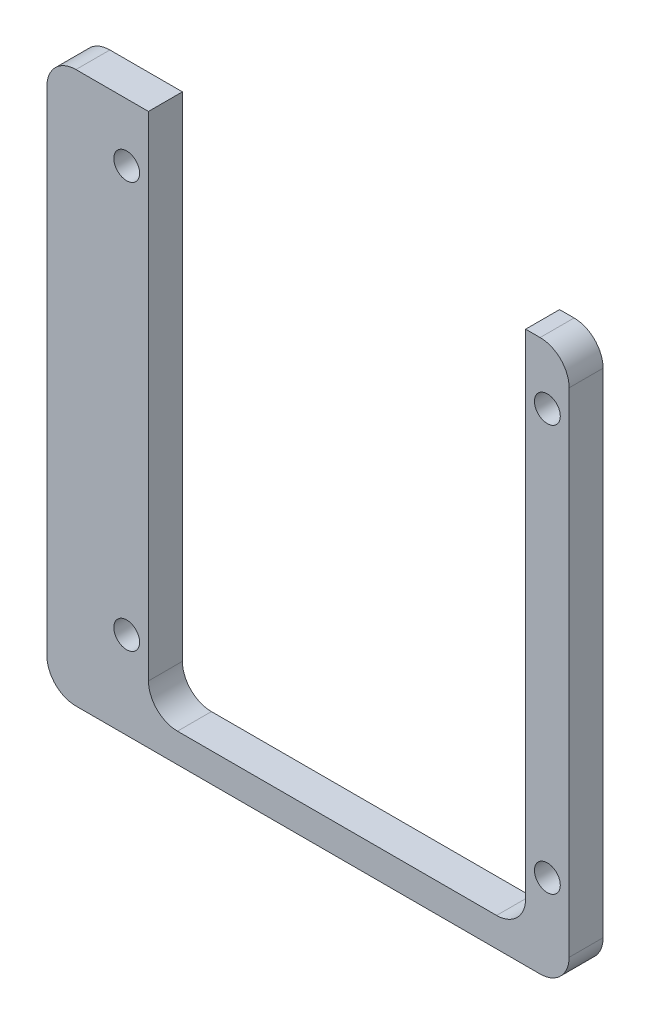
ISO-10303-21;
HEADER;
FILE_DESCRIPTION(('STEP AP214'),'2;1');
FILE_NAME('part.step','',(''),(''),'','','');
FILE_SCHEMA(('AUTOMOTIVE_DESIGN { 1 0 10303 214 1 1 1 1 }'));
ENDSEC;
DATA;
#1=APPLICATION_CONTEXT('core data for automotive mechanical design processes');
#2=APPLICATION_PROTOCOL_DEFINITION('international standard','automotive_design',2000,#1);
#3=PRODUCT_CONTEXT('',#1,'mechanical');
#4=PRODUCT('Part','Part','',(#3));
#5=PRODUCT_RELATED_PRODUCT_CATEGORY('part','',(#4));
#6=PRODUCT_DEFINITION_FORMATION('','',#4);
#7=PRODUCT_DEFINITION_CONTEXT('part definition',#1,'design');
#8=PRODUCT_DEFINITION('design','',#6,#7);
#9=PRODUCT_DEFINITION_SHAPE('','',#8);
#10=(LENGTH_UNIT() NAMED_UNIT(*) SI_UNIT(.MILLI.,.METRE.));
#11=(NAMED_UNIT(*) PLANE_ANGLE_UNIT() SI_UNIT($,.RADIAN.));
#12=(NAMED_UNIT(*) SI_UNIT($,.STERADIAN.) SOLID_ANGLE_UNIT());
#13=UNCERTAINTY_MEASURE_WITH_UNIT(LENGTH_MEASURE(1.E-05),#10,'distance_accuracy_value','');
#14=(GEOMETRIC_REPRESENTATION_CONTEXT(3) GLOBAL_UNCERTAINTY_ASSIGNED_CONTEXT((#13)) GLOBAL_UNIT_ASSIGNED_CONTEXT((#10,
#11,#12)) REPRESENTATION_CONTEXT('',''));
#15=CARTESIAN_POINT('',(0.,0.,0.));
#16=DIRECTION('',(0.,0.,1.));
#17=DIRECTION('',(1.,0.,0.));
#18=AXIS2_PLACEMENT_3D('',#15,#16,#17);
#19=CARTESIAN_POINT('',(-22.86,24.13,2.9718));
#20=DIRECTION('',(0.,-1.,0.));
#21=DIRECTION('',(0.,0.,-1.));
#22=AXIS2_PLACEMENT_3D('',#19,#20,#21);
#23=PLANE('',#22);
#24=DIRECTION('',(-1.,0.,0.));
#25=VECTOR('',#24,1.);
#26=CARTESIAN_POINT('',(-22.86,24.13,2.9718));
#27=LINE('',#26,#25);
#28=CARTESIAN_POINT('',(20.32,24.13,2.9718));
#29=VERTEX_POINT('',#28);
#30=CARTESIAN_POINT('',(19.05,24.13,2.9718));
#31=VERTEX_POINT('',#30);
#32=EDGE_CURVE('E182',#29,#31,#27,.T.);
#33=ORIENTED_EDGE('',*,*,#32,.F.);
#34=DIRECTION('',(0.,0.,-1.));
#35=VECTOR('',#34,1.);
#36=CARTESIAN_POINT('',(20.32,24.13,2.9718));
#37=LINE('',#36,#35);
#38=CARTESIAN_POINT('',(20.32,24.13,0.));
#39=VERTEX_POINT('',#38);
#40=EDGE_CURVE('E148',#29,#39,#37,.T.);
#41=ORIENTED_EDGE('',*,*,#40,.T.);
#42=DIRECTION('',(-1.,0.,0.));
#43=VECTOR('',#42,1.);
#44=CARTESIAN_POINT('',(-22.86,24.13,0.));
#45=LINE('',#44,#43);
#46=CARTESIAN_POINT('',(19.05,24.13,0.));
#47=VERTEX_POINT('',#46);
#48=EDGE_CURVE('E143',#39,#47,#45,.T.);
#49=ORIENTED_EDGE('',*,*,#48,.T.);
#50=DIRECTION('',(0.,0.,1.));
#51=VECTOR('',#50,1.);
#52=CARTESIAN_POINT('',(19.05,24.13,0.));
#53=LINE('',#52,#51);
#54=EDGE_CURVE('E146',#47,#31,#53,.T.);
#55=ORIENTED_EDGE('',*,*,#54,.T.);
#56=EDGE_LOOP('',(#33,#41,#49,#55));
#57=FACE_BOUND('',#56,.T.);
#58=ADVANCED_FACE('F39',(#57),#23,.F.);
#59=CARTESIAN_POINT('',(22.86,24.13,2.9718));
#60=DIRECTION('',(-1.,0.,0.));
#61=DIRECTION('',(0.,-1.,0.));
#62=AXIS2_PLACEMENT_3D('',#59,#60,#61);
#63=PLANE('',#62);
#64=DIRECTION('',(0.,1.,0.));
#65=VECTOR('',#64,1.);
#66=CARTESIAN_POINT('',(22.86,24.13,2.9718));
#67=LINE('',#66,#65);
#68=CARTESIAN_POINT('',(22.86,-21.59,2.9718));
#69=VERTEX_POINT('',#68);
#70=CARTESIAN_POINT('',(22.86,21.59,2.9718));
#71=VERTEX_POINT('',#70);
#72=EDGE_CURVE('E178',#69,#71,#67,.T.);
#73=ORIENTED_EDGE('',*,*,#72,.F.);
#74=DIRECTION('',(0.,0.,-1.));
#75=VECTOR('',#74,1.);
#76=CARTESIAN_POINT('',(22.86,-21.59,2.9718));
#77=LINE('',#76,#75);
#78=CARTESIAN_POINT('',(22.86,-21.59,0.));
#79=VERTEX_POINT('',#78);
#80=EDGE_CURVE('E196',#69,#79,#77,.T.);
#81=ORIENTED_EDGE('',*,*,#80,.T.);
#82=DIRECTION('',(0.,1.,0.));
#83=VECTOR('',#82,1.);
#84=CARTESIAN_POINT('',(22.86,24.13,0.));
#85=LINE('',#84,#83);
#86=CARTESIAN_POINT('',(22.86,21.59,0.));
#87=VERTEX_POINT('',#86);
#88=EDGE_CURVE('E173',#79,#87,#85,.T.);
#89=ORIENTED_EDGE('',*,*,#88,.T.);
#90=DIRECTION('',(0.,0.,-1.));
#91=VECTOR('',#90,1.);
#92=CARTESIAN_POINT('',(22.86,21.59,2.9718));
#93=LINE('',#92,#91);
#94=EDGE_CURVE('E189',#87,#71,#93,.F.);
#95=ORIENTED_EDGE('',*,*,#94,.T.);
#96=EDGE_LOOP('',(#73,#81,#89,#95));
#97=FACE_BOUND('',#96,.T.);
#98=ADVANCED_FACE('F317',(#97),#63,.F.);
#99=CARTESIAN_POINT('',(-13.97,24.13,0.));
#100=VERTEX_POINT('',#99);
#101=CARTESIAN_POINT('',(-20.32,24.13,0.));
#102=VERTEX_POINT('',#101);
#103=EDGE_CURVE('E151',#100,#102,#45,.T.);
#104=ORIENTED_EDGE('',*,*,#103,.T.);
#105=DIRECTION('',(0.,0.,-1.));
#106=VECTOR('',#105,1.);
#107=CARTESIAN_POINT('',(-20.32,24.13,2.9718));
#108=LINE('',#107,#106);
#109=CARTESIAN_POINT('',(-20.32,24.13,2.9718));
#110=VERTEX_POINT('',#109);
#111=EDGE_CURVE('E223',#102,#110,#108,.F.);
#112=ORIENTED_EDGE('',*,*,#111,.T.);
#113=CARTESIAN_POINT('',(-13.97,24.13,2.9718));
#114=VERTEX_POINT('',#113);
#115=EDGE_CURVE('E180',#114,#110,#27,.T.);
#116=ORIENTED_EDGE('',*,*,#115,.F.);
#117=DIRECTION('',(0.,0.,1.));
#118=VECTOR('',#117,1.);
#119=CARTESIAN_POINT('',(-13.97,24.13,0.));
#120=LINE('',#119,#118);
#121=EDGE_CURVE('E170',#100,#114,#120,.T.);
#122=ORIENTED_EDGE('',*,*,#121,.F.);
#123=EDGE_LOOP('',(#104,#112,#116,#122));
#124=FACE_BOUND('',#123,.T.);
#125=ADVANCED_FACE('F319',(#124),#23,.F.);
#126=CARTESIAN_POINT('',(-22.86,24.13,2.9718));
#127=DIRECTION('',(1.,0.,0.));
#128=DIRECTION('',(0.,1.,0.));
#129=AXIS2_PLACEMENT_3D('',#126,#127,#128);
#130=PLANE('',#129);
#131=DIRECTION('',(0.,-1.,0.));
#132=VECTOR('',#131,1.);
#133=CARTESIAN_POINT('',(-22.86,24.13,0.));
#134=LINE('',#133,#132);
#135=CARTESIAN_POINT('',(-22.86,21.59,0.));
#136=VERTEX_POINT('',#135);
#137=CARTESIAN_POINT('',(-22.86,-21.59,0.));
#138=VERTEX_POINT('',#137);
#139=EDGE_CURVE('E150',#136,#138,#134,.T.);
#140=ORIENTED_EDGE('',*,*,#139,.T.);
#141=DIRECTION('',(0.,0.,-1.));
#142=VECTOR('',#141,1.);
#143=CARTESIAN_POINT('',(-22.86,-21.59,2.9718));
#144=LINE('',#143,#142);
#145=CARTESIAN_POINT('',(-22.86,-21.59,2.9718));
#146=VERTEX_POINT('',#145);
#147=EDGE_CURVE('E62',#138,#146,#144,.F.);
#148=ORIENTED_EDGE('',*,*,#147,.T.);
#149=DIRECTION('',(0.,-1.,0.));
#150=VECTOR('',#149,1.);
#151=CARTESIAN_POINT('',(-22.86,24.13,2.9718));
#152=LINE('',#151,#150);
#153=CARTESIAN_POINT('',(-22.86,21.59,2.9718));
#154=VERTEX_POINT('',#153);
#155=EDGE_CURVE('E184',#154,#146,#152,.T.);
#156=ORIENTED_EDGE('',*,*,#155,.F.);
#157=DIRECTION('',(0.,0.,-1.));
#158=VECTOR('',#157,1.);
#159=CARTESIAN_POINT('',(-22.86,21.59,2.9718));
#160=LINE('',#159,#158);
#161=EDGE_CURVE('E219',#154,#136,#160,.T.);
#162=ORIENTED_EDGE('',*,*,#161,.T.);
#163=EDGE_LOOP('',(#140,#148,#156,#162));
#164=FACE_BOUND('',#163,.T.);
#165=ADVANCED_FACE('F327',(#164),#130,.F.);
#166=CARTESIAN_POINT('',(-22.86,-24.13,2.9718));
#167=DIRECTION('',(0.,1.,0.));
#168=DIRECTION('',(0.,0.,1.));
#169=AXIS2_PLACEMENT_3D('',#166,#167,#168);
#170=PLANE('',#169);
#171=DIRECTION('',(1.,0.,0.));
#172=VECTOR('',#171,1.);
#173=CARTESIAN_POINT('',(-22.86,-24.13,0.));
#174=LINE('',#173,#172);
#175=CARTESIAN_POINT('',(-20.32,-24.13,0.));
#176=VERTEX_POINT('',#175);
#177=CARTESIAN_POINT('',(20.32,-24.13,0.));
#178=VERTEX_POINT('',#177);
#179=EDGE_CURVE('E181',#176,#178,#174,.T.);
#180=ORIENTED_EDGE('',*,*,#179,.T.);
#181=DIRECTION('',(0.,0.,-1.));
#182=VECTOR('',#181,1.);
#183=CARTESIAN_POINT('',(20.32,-24.13,2.9718));
#184=LINE('',#183,#182);
#185=CARTESIAN_POINT('',(20.32,-24.13,2.9718));
#186=VERTEX_POINT('',#185);
#187=EDGE_CURVE('E210',#178,#186,#184,.F.);
#188=ORIENTED_EDGE('',*,*,#187,.T.);
#189=DIRECTION('',(1.,0.,0.));
#190=VECTOR('',#189,1.);
#191=CARTESIAN_POINT('',(-22.86,-24.13,2.9718));
#192=LINE('',#191,#190);
#193=CARTESIAN_POINT('',(-20.32,-24.13,2.9718));
#194=VERTEX_POINT('',#193);
#195=EDGE_CURVE('E186',#194,#186,#192,.T.);
#196=ORIENTED_EDGE('',*,*,#195,.F.);
#197=DIRECTION('',(0.,0.,-1.));
#198=VECTOR('',#197,1.);
#199=CARTESIAN_POINT('',(-20.32,-24.13,2.9718));
#200=LINE('',#199,#198);
#201=EDGE_CURVE('E207',#194,#176,#200,.T.);
#202=ORIENTED_EDGE('',*,*,#201,.T.);
#203=EDGE_LOOP('',(#180,#188,#196,#202));
#204=FACE_BOUND('',#203,.T.);
#205=ADVANCED_FACE('F293',(#204),#170,.F.);
#206=CARTESIAN_POINT('',(0.,0.,2.9718));
#207=DIRECTION('',(0.,0.,1.));
#208=DIRECTION('',(1.,0.,0.));
#209=AXIS2_PLACEMENT_3D('',#206,#207,#208);
#210=PLANE('',#209);
#211=CARTESIAN_POINT('',(-15.875,19.05,2.9718));
#212=DIRECTION('',(0.,0.,1.));
#213=DIRECTION('',(1.,0.,0.));
#214=AXIS2_PLACEMENT_3D('',#211,#212,#213);
#215=CIRCLE('',#214,1.1303);
#216=CARTESIAN_POINT('',(-14.7447,19.05,2.9718));
#217=VERTEX_POINT('',#216);
#218=EDGE_CURVE('E285',#217,#217,#215,.T.);
#219=ORIENTED_EDGE('',*,*,#218,.F.);
#220=EDGE_LOOP('',(#219));
#221=FACE_BOUND('',#220,.T.);
#222=CARTESIAN_POINT('',(-15.875,-16.51,2.9718));
#223=DIRECTION('',(0.,0.,1.));
#224=DIRECTION('',(1.,0.,0.));
#225=AXIS2_PLACEMENT_3D('',#222,#223,#224);
#226=CIRCLE('',#225,1.1303);
#227=CARTESIAN_POINT('',(-14.7447,-16.51,2.9718));
#228=VERTEX_POINT('',#227);
#229=EDGE_CURVE('E279',#228,#228,#226,.T.);
#230=ORIENTED_EDGE('',*,*,#229,.F.);
#231=EDGE_LOOP('',(#230));
#232=FACE_BOUND('',#231,.T.);
#233=CARTESIAN_POINT('',(20.955,19.05,2.9718));
#234=DIRECTION('',(0.,0.,1.));
#235=DIRECTION('',(1.,0.,0.));
#236=AXIS2_PLACEMENT_3D('',#233,#234,#235);
#237=CIRCLE('',#236,1.1303);
#238=CARTESIAN_POINT('',(22.0853,19.05,2.9718));
#239=VERTEX_POINT('',#238);
#240=EDGE_CURVE('E273',#239,#239,#237,.T.);
#241=ORIENTED_EDGE('',*,*,#240,.F.);
#242=EDGE_LOOP('',(#241));
#243=FACE_BOUND('',#242,.T.);
#244=CARTESIAN_POINT('',(20.955,-16.51,2.9718));
#245=DIRECTION('',(0.,0.,1.));
#246=DIRECTION('',(1.,0.,0.));
#247=AXIS2_PLACEMENT_3D('',#244,#245,#246);
#248=CIRCLE('',#247,1.1303);
#249=CARTESIAN_POINT('',(22.0853,-16.51,2.9718));
#250=VERTEX_POINT('',#249);
#251=EDGE_CURVE('E264',#250,#250,#248,.T.);
#252=ORIENTED_EDGE('',*,*,#251,.F.);
#253=EDGE_LOOP('',(#252));
#254=FACE_BOUND('',#253,.T.);
#255=ORIENTED_EDGE('',*,*,#195,.T.);
#256=CARTESIAN_POINT('',(20.32,-21.59,2.9718));
#257=DIRECTION('',(0.,0.,1.));
#258=DIRECTION('',(1.,0.,0.));
#259=AXIS2_PLACEMENT_3D('',#256,#257,#258);
#260=CIRCLE('',#259,2.54);
#261=EDGE_CURVE('E217',#186,#69,#260,.T.);
#262=ORIENTED_EDGE('',*,*,#261,.T.);
#263=ORIENTED_EDGE('',*,*,#72,.T.);
#264=CARTESIAN_POINT('',(20.32,21.59,2.9718));
#265=DIRECTION('',(0.,0.,1.));
#266=DIRECTION('',(1.,0.,0.));
#267=AXIS2_PLACEMENT_3D('',#264,#265,#266);
#268=CIRCLE('',#267,2.54);
#269=EDGE_CURVE('E54',#71,#29,#268,.T.);
#270=ORIENTED_EDGE('',*,*,#269,.T.);
#271=ORIENTED_EDGE('',*,*,#32,.T.);
#272=DIRECTION('',(0.,1.,0.));
#273=VECTOR('',#272,1.);
#274=CARTESIAN_POINT('',(19.05,24.13,2.9718));
#275=LINE('',#274,#273);
#276=CARTESIAN_POINT('',(19.05,-19.05,2.9718));
#277=VERTEX_POINT('',#276);
#278=EDGE_CURVE('E169',#277,#31,#275,.T.);
#279=ORIENTED_EDGE('',*,*,#278,.F.);
#280=CARTESIAN_POINT('',(16.51,-19.05,2.9718));
#281=DIRECTION('',(0.,0.,1.));
#282=DIRECTION('',(1.,0.,0.));
#283=AXIS2_PLACEMENT_3D('',#280,#281,#282);
#284=CIRCLE('',#283,2.54);
#285=CARTESIAN_POINT('',(16.51,-21.59,2.9718));
#286=VERTEX_POINT('',#285);
#287=EDGE_CURVE('E235',#277,#286,#284,.F.);
#288=ORIENTED_EDGE('',*,*,#287,.T.);
#289=DIRECTION('',(1.,0.,0.));
#290=VECTOR('',#289,1.);
#291=CARTESIAN_POINT('',(-13.97,-21.59,2.9718));
#292=LINE('',#291,#290);
#293=CARTESIAN_POINT('',(-11.43,-21.59,2.9718));
#294=VERTEX_POINT('',#293);
#295=EDGE_CURVE('E164',#294,#286,#292,.T.);
#296=ORIENTED_EDGE('',*,*,#295,.F.);
#297=CARTESIAN_POINT('',(-11.43,-19.05,2.9718));
#298=DIRECTION('',(0.,0.,1.));
#299=DIRECTION('',(1.,0.,0.));
#300=AXIS2_PLACEMENT_3D('',#297,#298,#299);
#301=CIRCLE('',#300,2.54);
#302=CARTESIAN_POINT('',(-13.97,-19.05,2.9718));
#303=VERTEX_POINT('',#302);
#304=EDGE_CURVE('E47',#294,#303,#301,.F.);
#305=ORIENTED_EDGE('',*,*,#304,.T.);
#306=DIRECTION('',(0.,-1.,0.));
#307=VECTOR('',#306,1.);
#308=CARTESIAN_POINT('',(-13.97,24.13,2.9718));
#309=LINE('',#308,#307);
#310=EDGE_CURVE('E242',#114,#303,#309,.T.);
#311=ORIENTED_EDGE('',*,*,#310,.F.);
#312=ORIENTED_EDGE('',*,*,#115,.T.);
#313=CARTESIAN_POINT('',(-20.32,21.59,2.9718));
#314=DIRECTION('',(0.,0.,1.));
#315=DIRECTION('',(1.,0.,0.));
#316=AXIS2_PLACEMENT_3D('',#313,#314,#315);
#317=CIRCLE('',#316,2.54);
#318=EDGE_CURVE('E213',#110,#154,#317,.T.);
#319=ORIENTED_EDGE('',*,*,#318,.T.);
#320=ORIENTED_EDGE('',*,*,#155,.T.);
#321=CARTESIAN_POINT('',(-20.32,-21.59,2.9718));
#322=DIRECTION('',(0.,0.,1.));
#323=DIRECTION('',(1.,0.,0.));
#324=AXIS2_PLACEMENT_3D('',#321,#322,#323);
#325=CIRCLE('',#324,2.54);
#326=EDGE_CURVE('E215',#146,#194,#325,.T.);
#327=ORIENTED_EDGE('',*,*,#326,.T.);
#328=EDGE_LOOP('',(#255,#262,#263,#270,#271,#279,#288,#296,#305,#311,#312,#319,#320,#327));
#329=FACE_BOUND('',#328,.T.);
#330=ADVANCED_FACE('F240',(#221,#232,#243,#254,#329),#210,.T.);
#331=CARTESIAN_POINT('',(0.,0.,0.));
#332=DIRECTION('',(0.,0.,1.));
#333=DIRECTION('',(1.,0.,0.));
#334=AXIS2_PLACEMENT_3D('',#331,#332,#333);
#335=PLANE('',#334);
#336=CARTESIAN_POINT('',(-15.875,19.05,0.));
#337=DIRECTION('',(0.,0.,1.));
#338=DIRECTION('',(1.,0.,0.));
#339=AXIS2_PLACEMENT_3D('',#336,#337,#338);
#340=CIRCLE('',#339,1.1303);
#341=CARTESIAN_POINT('',(-14.7447,19.05,0.));
#342=VERTEX_POINT('',#341);
#343=EDGE_CURVE('E282',#342,#342,#340,.T.);
#344=ORIENTED_EDGE('',*,*,#343,.T.);
#345=EDGE_LOOP('',(#344));
#346=FACE_BOUND('',#345,.T.);
#347=CARTESIAN_POINT('',(-15.875,-16.51,0.));
#348=DIRECTION('',(0.,0.,1.));
#349=DIRECTION('',(1.,0.,0.));
#350=AXIS2_PLACEMENT_3D('',#347,#348,#349);
#351=CIRCLE('',#350,1.1303);
#352=CARTESIAN_POINT('',(-14.7447,-16.51,0.));
#353=VERTEX_POINT('',#352);
#354=EDGE_CURVE('E276',#353,#353,#351,.T.);
#355=ORIENTED_EDGE('',*,*,#354,.T.);
#356=EDGE_LOOP('',(#355));
#357=FACE_BOUND('',#356,.T.);
#358=CARTESIAN_POINT('',(20.955,19.05,0.));
#359=DIRECTION('',(0.,0.,1.));
#360=DIRECTION('',(1.,0.,0.));
#361=AXIS2_PLACEMENT_3D('',#358,#359,#360);
#362=CIRCLE('',#361,1.1303);
#363=CARTESIAN_POINT('',(22.0853,19.05,0.));
#364=VERTEX_POINT('',#363);
#365=EDGE_CURVE('E270',#364,#364,#362,.T.);
#366=ORIENTED_EDGE('',*,*,#365,.T.);
#367=EDGE_LOOP('',(#366));
#368=FACE_BOUND('',#367,.T.);
#369=CARTESIAN_POINT('',(20.955,-16.51,0.));
#370=DIRECTION('',(0.,0.,1.));
#371=DIRECTION('',(1.,0.,0.));
#372=AXIS2_PLACEMENT_3D('',#369,#370,#371);
#373=CIRCLE('',#372,1.1303);
#374=CARTESIAN_POINT('',(22.0853,-16.51,0.));
#375=VERTEX_POINT('',#374);
#376=EDGE_CURVE('E261',#375,#375,#373,.T.);
#377=ORIENTED_EDGE('',*,*,#376,.T.);
#378=EDGE_LOOP('',(#377));
#379=FACE_BOUND('',#378,.T.);
#380=ORIENTED_EDGE('',*,*,#88,.F.);
#381=CARTESIAN_POINT('',(20.32,-21.59,0.));
#382=DIRECTION('',(0.,0.,1.));
#383=DIRECTION('',(1.,0.,0.));
#384=AXIS2_PLACEMENT_3D('',#381,#382,#383);
#385=CIRCLE('',#384,2.54);
#386=EDGE_CURVE('E205',#79,#178,#385,.F.);
#387=ORIENTED_EDGE('',*,*,#386,.T.);
#388=ORIENTED_EDGE('',*,*,#179,.F.);
#389=CARTESIAN_POINT('',(-20.32,-21.59,0.));
#390=DIRECTION('',(0.,0.,1.));
#391=DIRECTION('',(1.,0.,0.));
#392=AXIS2_PLACEMENT_3D('',#389,#390,#391);
#393=CIRCLE('',#392,2.54);
#394=EDGE_CURVE('E203',#176,#138,#393,.F.);
#395=ORIENTED_EDGE('',*,*,#394,.T.);
#396=ORIENTED_EDGE('',*,*,#139,.F.);
#397=CARTESIAN_POINT('',(-20.32,21.59,0.));
#398=DIRECTION('',(0.,0.,1.));
#399=DIRECTION('',(1.,0.,0.));
#400=AXIS2_PLACEMENT_3D('',#397,#398,#399);
#401=CIRCLE('',#400,2.54);
#402=EDGE_CURVE('E201',#136,#102,#401,.F.);
#403=ORIENTED_EDGE('',*,*,#402,.T.);
#404=ORIENTED_EDGE('',*,*,#103,.F.);
#405=DIRECTION('',(0.,-1.,0.));
#406=VECTOR('',#405,1.);
#407=CARTESIAN_POINT('',(-13.97,24.13,0.));
#408=LINE('',#407,#406);
#409=CARTESIAN_POINT('',(-13.97,-19.05,0.));
#410=VERTEX_POINT('',#409);
#411=EDGE_CURVE('E163',#100,#410,#408,.T.);
#412=ORIENTED_EDGE('',*,*,#411,.T.);
#413=CARTESIAN_POINT('',(-11.43,-19.05,0.));
#414=DIRECTION('',(0.,0.,1.));
#415=DIRECTION('',(1.,0.,0.));
#416=AXIS2_PLACEMENT_3D('',#413,#414,#415);
#417=CIRCLE('',#416,2.54);
#418=CARTESIAN_POINT('',(-11.43,-21.59,0.));
#419=VERTEX_POINT('',#418);
#420=EDGE_CURVE('E11',#410,#419,#417,.T.);
#421=ORIENTED_EDGE('',*,*,#420,.T.);
#422=DIRECTION('',(1.,0.,0.));
#423=VECTOR('',#422,1.);
#424=CARTESIAN_POINT('',(-13.97,-21.59,0.));
#425=LINE('',#424,#423);
#426=CARTESIAN_POINT('',(16.51,-21.59,0.));
#427=VERTEX_POINT('',#426);
#428=EDGE_CURVE('E171',#419,#427,#425,.T.);
#429=ORIENTED_EDGE('',*,*,#428,.T.);
#430=CARTESIAN_POINT('',(16.51,-19.05,0.));
#431=DIRECTION('',(0.,0.,1.));
#432=DIRECTION('',(1.,0.,0.));
#433=AXIS2_PLACEMENT_3D('',#430,#431,#432);
#434=CIRCLE('',#433,2.54);
#435=CARTESIAN_POINT('',(19.05,-19.05,0.));
#436=VERTEX_POINT('',#435);
#437=EDGE_CURVE('E159',#427,#436,#434,.T.);
#438=ORIENTED_EDGE('',*,*,#437,.T.);
#439=DIRECTION('',(0.,1.,0.));
#440=VECTOR('',#439,1.);
#441=CARTESIAN_POINT('',(19.05,24.13,0.));
#442=LINE('',#441,#440);
#443=EDGE_CURVE('E154',#436,#47,#442,.T.);
#444=ORIENTED_EDGE('',*,*,#443,.T.);
#445=ORIENTED_EDGE('',*,*,#48,.F.);
#446=CARTESIAN_POINT('',(20.32,21.59,0.));
#447=DIRECTION('',(0.,0.,1.));
#448=DIRECTION('',(1.,0.,0.));
#449=AXIS2_PLACEMENT_3D('',#446,#447,#448);
#450=CIRCLE('',#449,2.54);
#451=EDGE_CURVE('E199',#39,#87,#450,.F.);
#452=ORIENTED_EDGE('',*,*,#451,.T.);
#453=EDGE_LOOP('',(#380,#387,#388,#395,#396,#403,#404,#412,#421,#429,#438,#444,#445,#452));
#454=FACE_BOUND('',#453,.T.);
#455=ADVANCED_FACE('F156',(#346,#357,#368,#379,#454),#335,.F.);
#456=CARTESIAN_POINT('',(19.05,24.13,0.));
#457=DIRECTION('',(1.,0.,0.));
#458=DIRECTION('',(0.,1.,0.));
#459=AXIS2_PLACEMENT_3D('',#456,#457,#458);
#460=PLANE('',#459);
#461=ORIENTED_EDGE('',*,*,#443,.F.);
#462=DIRECTION('',(0.,0.,1.));
#463=VECTOR('',#462,1.);
#464=CARTESIAN_POINT('',(19.05,-19.05,2.9718));
#465=LINE('',#464,#463);
#466=EDGE_CURVE('E226',#436,#277,#465,.T.);
#467=ORIENTED_EDGE('',*,*,#466,.T.);
#468=ORIENTED_EDGE('',*,*,#278,.T.);
#469=ORIENTED_EDGE('',*,*,#54,.F.);
#470=EDGE_LOOP('',(#461,#467,#468,#469));
#471=FACE_BOUND('',#470,.T.);
#472=ADVANCED_FACE('F167',(#471),#460,.F.);
#473=CARTESIAN_POINT('',(-13.97,-21.59,0.));
#474=DIRECTION('',(0.,-1.,0.));
#475=DIRECTION('',(0.,0.,-1.));
#476=AXIS2_PLACEMENT_3D('',#473,#474,#475);
#477=PLANE('',#476);
#478=ORIENTED_EDGE('',*,*,#295,.T.);
#479=DIRECTION('',(0.,0.,1.));
#480=VECTOR('',#479,1.);
#481=CARTESIAN_POINT('',(16.51,-21.59,0.));
#482=LINE('',#481,#480);
#483=EDGE_CURVE('E231',#286,#427,#482,.F.);
#484=ORIENTED_EDGE('',*,*,#483,.T.);
#485=ORIENTED_EDGE('',*,*,#428,.F.);
#486=DIRECTION('',(0.,0.,1.));
#487=VECTOR('',#486,1.);
#488=CARTESIAN_POINT('',(-11.43,-21.59,2.9718));
#489=LINE('',#488,#487);
#490=EDGE_CURVE('E228',#419,#294,#489,.T.);
#491=ORIENTED_EDGE('',*,*,#490,.T.);
#492=EDGE_LOOP('',(#478,#484,#485,#491));
#493=FACE_BOUND('',#492,.T.);
#494=ADVANCED_FACE('F257',(#493),#477,.F.);
#495=CARTESIAN_POINT('',(-13.97,24.13,0.));
#496=DIRECTION('',(-1.,0.,0.));
#497=DIRECTION('',(0.,-1.,0.));
#498=AXIS2_PLACEMENT_3D('',#495,#496,#497);
#499=PLANE('',#498);
#500=ORIENTED_EDGE('',*,*,#310,.T.);
#501=DIRECTION('',(0.,0.,1.));
#502=VECTOR('',#501,1.);
#503=CARTESIAN_POINT('',(-13.97,-19.05,0.));
#504=LINE('',#503,#502);
#505=EDGE_CURVE('E233',#303,#410,#504,.F.);
#506=ORIENTED_EDGE('',*,*,#505,.T.);
#507=ORIENTED_EDGE('',*,*,#411,.F.);
#508=ORIENTED_EDGE('',*,*,#121,.T.);
#509=EDGE_LOOP('',(#500,#506,#507,#508));
#510=FACE_BOUND('',#509,.T.);
#511=ADVANCED_FACE('F249',(#510),#499,.F.);
#512=CARTESIAN_POINT('',(20.955,-16.51,2.9718));
#513=DIRECTION('',(0.,0.,1.));
#514=DIRECTION('',(1.,0.,0.));
#515=AXIS2_PLACEMENT_3D('',#512,#513,#514);
#516=CYLINDRICAL_SURFACE('',#515,1.1303);
#517=ORIENTED_EDGE('',*,*,#376,.F.);
#518=EDGE_LOOP('',(#517));
#519=FACE_BOUND('',#518,.T.);
#520=ORIENTED_EDGE('',*,*,#251,.T.);
#521=EDGE_LOOP('',(#520));
#522=FACE_BOUND('',#521,.T.);
#523=ADVANCED_FACE('F301',(#519,#522),#516,.F.);
#524=CARTESIAN_POINT('',(20.955,19.05,2.9718));
#525=DIRECTION('',(0.,0.,1.));
#526=DIRECTION('',(1.,0.,0.));
#527=AXIS2_PLACEMENT_3D('',#524,#525,#526);
#528=CYLINDRICAL_SURFACE('',#527,1.1303);
#529=ORIENTED_EDGE('',*,*,#365,.F.);
#530=EDGE_LOOP('',(#529));
#531=FACE_BOUND('',#530,.T.);
#532=ORIENTED_EDGE('',*,*,#240,.T.);
#533=EDGE_LOOP('',(#532));
#534=FACE_BOUND('',#533,.T.);
#535=ADVANCED_FACE('F303',(#531,#534),#528,.F.);
#536=CARTESIAN_POINT('',(-15.875,-16.51,2.9718));
#537=DIRECTION('',(0.,0.,1.));
#538=DIRECTION('',(1.,0.,0.));
#539=AXIS2_PLACEMENT_3D('',#536,#537,#538);
#540=CYLINDRICAL_SURFACE('',#539,1.1303);
#541=ORIENTED_EDGE('',*,*,#354,.F.);
#542=EDGE_LOOP('',(#541));
#543=FACE_BOUND('',#542,.T.);
#544=ORIENTED_EDGE('',*,*,#229,.T.);
#545=EDGE_LOOP('',(#544));
#546=FACE_BOUND('',#545,.T.);
#547=ADVANCED_FACE('F310',(#543,#546),#540,.F.);
#548=CARTESIAN_POINT('',(-15.875,19.05,2.9718));
#549=DIRECTION('',(0.,0.,1.));
#550=DIRECTION('',(1.,0.,0.));
#551=AXIS2_PLACEMENT_3D('',#548,#549,#550);
#552=CYLINDRICAL_SURFACE('',#551,1.1303);
#553=ORIENTED_EDGE('',*,*,#343,.F.);
#554=EDGE_LOOP('',(#553));
#555=FACE_BOUND('',#554,.T.);
#556=ORIENTED_EDGE('',*,*,#218,.T.);
#557=EDGE_LOOP('',(#556));
#558=FACE_BOUND('',#557,.T.);
#559=ADVANCED_FACE('F289',(#555,#558),#552,.F.);
#560=CARTESIAN_POINT('',(20.32,-21.59,2.9718));
#561=DIRECTION('',(0.,0.,-1.));
#562=DIRECTION('',(-1.,0.,0.));
#563=AXIS2_PLACEMENT_3D('',#560,#561,#562);
#564=CYLINDRICAL_SURFACE('',#563,2.54);
#565=ORIENTED_EDGE('',*,*,#261,.F.);
#566=ORIENTED_EDGE('',*,*,#187,.F.);
#567=ORIENTED_EDGE('',*,*,#386,.F.);
#568=ORIENTED_EDGE('',*,*,#80,.F.);
#569=EDGE_LOOP('',(#565,#566,#567,#568));
#570=FACE_BOUND('',#569,.T.);
#571=ADVANCED_FACE('F351',(#570),#564,.T.);
#572=CARTESIAN_POINT('',(-20.32,-21.59,2.9718));
#573=DIRECTION('',(0.,0.,-1.));
#574=DIRECTION('',(-1.,0.,0.));
#575=AXIS2_PLACEMENT_3D('',#572,#573,#574);
#576=CYLINDRICAL_SURFACE('',#575,2.54);
#577=ORIENTED_EDGE('',*,*,#326,.F.);
#578=ORIENTED_EDGE('',*,*,#147,.F.);
#579=ORIENTED_EDGE('',*,*,#394,.F.);
#580=ORIENTED_EDGE('',*,*,#201,.F.);
#581=EDGE_LOOP('',(#577,#578,#579,#580));
#582=FACE_BOUND('',#581,.T.);
#583=ADVANCED_FACE('F343',(#582),#576,.T.);
#584=CARTESIAN_POINT('',(-20.32,21.59,2.9718));
#585=DIRECTION('',(0.,0.,-1.));
#586=DIRECTION('',(-1.,0.,0.));
#587=AXIS2_PLACEMENT_3D('',#584,#585,#586);
#588=CYLINDRICAL_SURFACE('',#587,2.54);
#589=ORIENTED_EDGE('',*,*,#318,.F.);
#590=ORIENTED_EDGE('',*,*,#111,.F.);
#591=ORIENTED_EDGE('',*,*,#402,.F.);
#592=ORIENTED_EDGE('',*,*,#161,.F.);
#593=EDGE_LOOP('',(#589,#590,#591,#592));
#594=FACE_BOUND('',#593,.T.);
#595=ADVANCED_FACE('F336',(#594),#588,.T.);
#596=CARTESIAN_POINT('',(20.32,21.59,2.9718));
#597=DIRECTION('',(0.,0.,-1.));
#598=DIRECTION('',(-1.,0.,0.));
#599=AXIS2_PLACEMENT_3D('',#596,#597,#598);
#600=CYLINDRICAL_SURFACE('',#599,2.54);
#601=ORIENTED_EDGE('',*,*,#269,.F.);
#602=ORIENTED_EDGE('',*,*,#94,.F.);
#603=ORIENTED_EDGE('',*,*,#451,.F.);
#604=ORIENTED_EDGE('',*,*,#40,.F.);
#605=EDGE_LOOP('',(#601,#602,#603,#604));
#606=FACE_BOUND('',#605,.T.);
#607=ADVANCED_FACE('F354',(#606),#600,.T.);
#608=CARTESIAN_POINT('',(16.51,-19.05,0.));
#609=DIRECTION('',(0.,0.,-1.));
#610=DIRECTION('',(-1.,0.,0.));
#611=AXIS2_PLACEMENT_3D('',#608,#609,#610);
#612=CYLINDRICAL_SURFACE('',#611,2.54);
#613=ORIENTED_EDGE('',*,*,#437,.F.);
#614=ORIENTED_EDGE('',*,*,#483,.F.);
#615=ORIENTED_EDGE('',*,*,#287,.F.);
#616=ORIENTED_EDGE('',*,*,#466,.F.);
#617=EDGE_LOOP('',(#613,#614,#615,#616));
#618=FACE_BOUND('',#617,.T.);
#619=ADVANCED_FACE('F260',(#618),#612,.F.);
#620=CARTESIAN_POINT('',(-11.43,-19.05,0.));
#621=DIRECTION('',(0.,0.,-1.));
#622=DIRECTION('',(-1.,0.,0.));
#623=AXIS2_PLACEMENT_3D('',#620,#621,#622);
#624=CYLINDRICAL_SURFACE('',#623,2.54);
#625=ORIENTED_EDGE('',*,*,#420,.F.);
#626=ORIENTED_EDGE('',*,*,#505,.F.);
#627=ORIENTED_EDGE('',*,*,#304,.F.);
#628=ORIENTED_EDGE('',*,*,#490,.F.);
#629=EDGE_LOOP('',(#625,#626,#627,#628));
#630=FACE_BOUND('',#629,.T.);
#631=ADVANCED_FACE('F41',(#630),#624,.F.);
#632=CLOSED_SHELL('',(#58,#98,#125,#165,#205,#330,#455,#472,#494,#511,#523,#535,#547,#559,#571,
#583,#595,#607,#619,#631));
#633=MANIFOLD_SOLID_BREP('B2',#632);
#634=ADVANCED_BREP_SHAPE_REPRESENTATION('',(#18,#633),#14);
#635=SHAPE_DEFINITION_REPRESENTATION(#9,#634);
ENDSEC;
END-ISO-10303-21;
